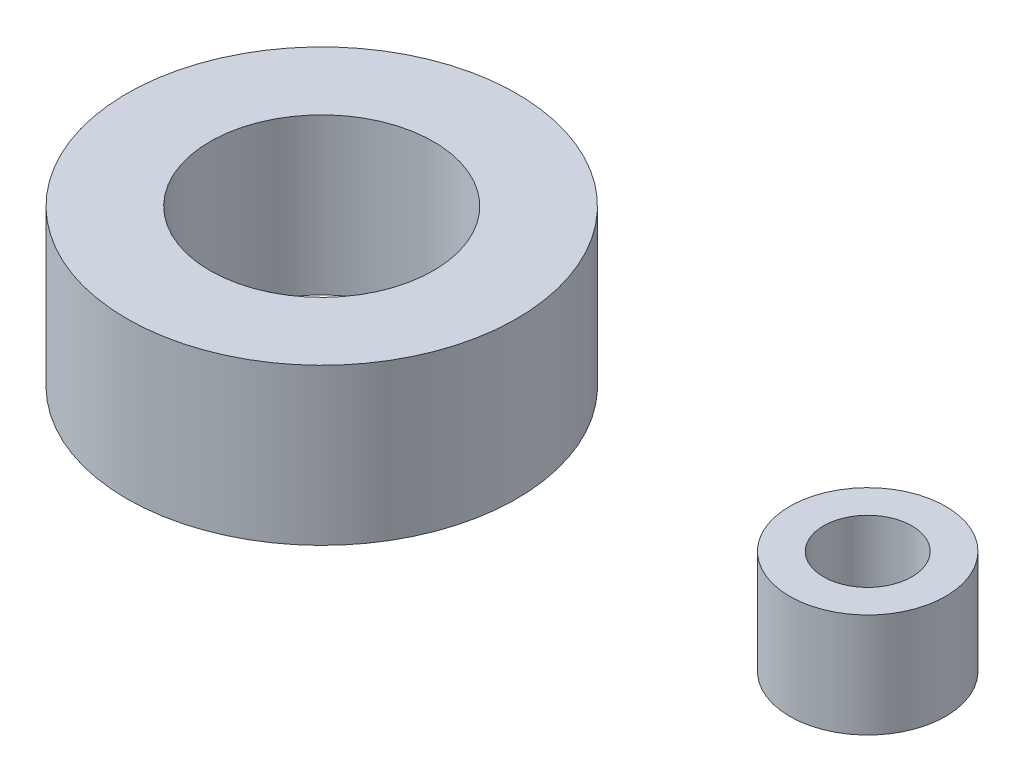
ISO-10303-21;
HEADER;
FILE_DESCRIPTION(('STEP AP214'),'2;1');
FILE_NAME('part.step','',(''),(''),'','','');
FILE_SCHEMA(('AUTOMOTIVE_DESIGN { 1 0 10303 214 1 1 1 1 }'));
ENDSEC;
DATA;
#1=APPLICATION_CONTEXT('core data for automotive mechanical design processes');
#2=APPLICATION_PROTOCOL_DEFINITION('international standard','automotive_design',2000,#1);
#3=PRODUCT_CONTEXT('',#1,'mechanical');
#4=PRODUCT('Part','Part','',(#3));
#5=PRODUCT_RELATED_PRODUCT_CATEGORY('part','',(#4));
#6=PRODUCT_DEFINITION_FORMATION('','',#4);
#7=PRODUCT_DEFINITION_CONTEXT('part definition',#1,'design');
#8=PRODUCT_DEFINITION('design','',#6,#7);
#9=PRODUCT_DEFINITION_SHAPE('','',#8);
#10=(LENGTH_UNIT() NAMED_UNIT(*) SI_UNIT(.MILLI.,.METRE.));
#11=(NAMED_UNIT(*) PLANE_ANGLE_UNIT() SI_UNIT($,.RADIAN.));
#12=(NAMED_UNIT(*) SI_UNIT($,.STERADIAN.) SOLID_ANGLE_UNIT());
#13=UNCERTAINTY_MEASURE_WITH_UNIT(LENGTH_MEASURE(1.E-05),#10,'distance_accuracy_value','');
#14=(GEOMETRIC_REPRESENTATION_CONTEXT(3) GLOBAL_UNCERTAINTY_ASSIGNED_CONTEXT((#13)) GLOBAL_UNIT_ASSIGNED_CONTEXT((#10,
#11,#12)) REPRESENTATION_CONTEXT('',''));
#15=CARTESIAN_POINT('',(0.,0.,0.));
#16=DIRECTION('',(0.,0.,1.));
#17=DIRECTION('',(1.,0.,0.));
#18=AXIS2_PLACEMENT_3D('',#15,#16,#17);
#19=CARTESIAN_POINT('',(105.,10.,0.));
#20=DIRECTION('',(0.,-1.,0.));
#21=DIRECTION('',(0.,0.,-1.));
#22=AXIS2_PLACEMENT_3D('',#19,#20,#21);
#23=CYLINDRICAL_SURFACE('',#22,8.50000000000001);
#24=CARTESIAN_POINT('',(105.,10.,0.));
#25=DIRECTION('',(0.,1.,0.));
#26=DIRECTION('',(0.,0.,1.));
#27=AXIS2_PLACEMENT_3D('',#24,#25,#26);
#28=CIRCLE('',#27,8.50000000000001);
#29=CARTESIAN_POINT('',(105.,10.,8.50000000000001));
#30=VERTEX_POINT('',#29);
#31=EDGE_CURVE('E46',#30,#30,#28,.T.);
#32=ORIENTED_EDGE('',*,*,#31,.T.);
#33=EDGE_LOOP('',(#32));
#34=FACE_BOUND('',#33,.T.);
#35=CARTESIAN_POINT('',(105.,-10.,0.));
#36=DIRECTION('',(0.,1.,0.));
#37=DIRECTION('',(0.,0.,1.));
#38=AXIS2_PLACEMENT_3D('',#35,#36,#37);
#39=CIRCLE('',#38,8.50000000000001);
#40=CARTESIAN_POINT('',(105.,-10.,8.50000000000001));
#41=VERTEX_POINT('',#40);
#42=EDGE_CURVE('E54',#41,#41,#39,.T.);
#43=ORIENTED_EDGE('',*,*,#42,.F.);
#44=EDGE_LOOP('',(#43));
#45=FACE_BOUND('',#44,.T.);
#46=ADVANCED_FACE('F40',(#34,#45),#23,.F.);
#47=CARTESIAN_POINT('',(105.,10.,0.));
#48=DIRECTION('',(0.,-1.,0.));
#49=DIRECTION('',(0.,0.,-1.));
#50=AXIS2_PLACEMENT_3D('',#47,#48,#49);
#51=CYLINDRICAL_SURFACE('',#50,15.);
#52=CARTESIAN_POINT('',(105.,10.,0.));
#53=DIRECTION('',(0.,1.,0.));
#54=DIRECTION('',(0.,0.,1.));
#55=AXIS2_PLACEMENT_3D('',#52,#53,#54);
#56=CIRCLE('',#55,15.);
#57=CARTESIAN_POINT('',(105.,10.,15.));
#58=VERTEX_POINT('',#57);
#59=EDGE_CURVE('E11',#58,#58,#56,.T.);
#60=ORIENTED_EDGE('',*,*,#59,.F.);
#61=EDGE_LOOP('',(#60));
#62=FACE_BOUND('',#61,.T.);
#63=CARTESIAN_POINT('',(105.,-10.,0.));
#64=DIRECTION('',(0.,1.,0.));
#65=DIRECTION('',(0.,0.,1.));
#66=AXIS2_PLACEMENT_3D('',#63,#64,#65);
#67=CIRCLE('',#66,15.);
#68=CARTESIAN_POINT('',(105.,-10.,15.));
#69=VERTEX_POINT('',#68);
#70=EDGE_CURVE('E50',#69,#69,#67,.T.);
#71=ORIENTED_EDGE('',*,*,#70,.T.);
#72=EDGE_LOOP('',(#71));
#73=FACE_BOUND('',#72,.T.);
#74=ADVANCED_FACE('F64',(#62,#73),#51,.T.);
#75=CARTESIAN_POINT('',(-94.7319877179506,10.,0.));
#76=DIRECTION('',(0.,1.,0.));
#77=DIRECTION('',(0.,0.,1.));
#78=AXIS2_PLACEMENT_3D('',#75,#76,#77);
#79=PLANE('',#78);
#80=ORIENTED_EDGE('',*,*,#31,.F.);
#81=EDGE_LOOP('',(#80));
#82=FACE_BOUND('',#81,.T.);
#83=ORIENTED_EDGE('',*,*,#59,.T.);
#84=EDGE_LOOP('',(#83));
#85=FACE_BOUND('',#84,.T.);
#86=ADVANCED_FACE('F68',(#82,#85),#79,.T.);
#87=CARTESIAN_POINT('',(-94.7319877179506,-10.,0.));
#88=DIRECTION('',(0.,1.,0.));
#89=DIRECTION('',(0.,0.,1.));
#90=AXIS2_PLACEMENT_3D('',#87,#88,#89);
#91=PLANE('',#90);
#92=ORIENTED_EDGE('',*,*,#42,.T.);
#93=EDGE_LOOP('',(#92));
#94=FACE_BOUND('',#93,.T.);
#95=ORIENTED_EDGE('',*,*,#70,.F.);
#96=EDGE_LOOP('',(#95));
#97=FACE_BOUND('',#96,.T.);
#98=ADVANCED_FACE('F60',(#94,#97),#91,.F.);
#99=CLOSED_SHELL('',(#46,#74,#86,#98));
#100=MANIFOLD_SOLID_BREP('B2',#99);
#101=CARTESIAN_POINT('',(0.,15.,0.));
#102=DIRECTION('',(0.,-1.,0.));
#103=DIRECTION('',(0.,0.,-1.));
#104=AXIS2_PLACEMENT_3D('',#101,#102,#103);
#105=CYLINDRICAL_SURFACE('',#104,21.5);
#106=CARTESIAN_POINT('',(0.,15.,0.));
#107=DIRECTION('',(0.,1.,0.));
#108=DIRECTION('',(0.,0.,1.));
#109=AXIS2_PLACEMENT_3D('',#106,#107,#108);
#110=CIRCLE('',#109,21.5);
#111=CARTESIAN_POINT('',(0.,15.,21.5));
#112=VERTEX_POINT('',#111);
#113=EDGE_CURVE('E107',#112,#112,#110,.T.);
#114=ORIENTED_EDGE('',*,*,#113,.T.);
#115=EDGE_LOOP('',(#114));
#116=FACE_BOUND('',#115,.T.);
#117=CARTESIAN_POINT('',(0.,-15.,0.));
#118=DIRECTION('',(0.,1.,0.));
#119=DIRECTION('',(0.,0.,1.));
#120=AXIS2_PLACEMENT_3D('',#117,#118,#119);
#121=CIRCLE('',#120,21.5);
#122=CARTESIAN_POINT('',(0.,-15.,21.5));
#123=VERTEX_POINT('',#122);
#124=EDGE_CURVE('E115',#123,#123,#121,.T.);
#125=ORIENTED_EDGE('',*,*,#124,.F.);
#126=EDGE_LOOP('',(#125));
#127=FACE_BOUND('',#126,.T.);
#128=ADVANCED_FACE('F101',(#116,#127),#105,.F.);
#129=CARTESIAN_POINT('',(0.,15.,0.));
#130=DIRECTION('',(0.,-1.,0.));
#131=DIRECTION('',(0.,0.,-1.));
#132=AXIS2_PLACEMENT_3D('',#129,#130,#131);
#133=CYLINDRICAL_SURFACE('',#132,37.5);
#134=CARTESIAN_POINT('',(0.,15.,0.));
#135=DIRECTION('',(0.,1.,0.));
#136=DIRECTION('',(0.,0.,1.));
#137=AXIS2_PLACEMENT_3D('',#134,#135,#136);
#138=CIRCLE('',#137,37.5);
#139=CARTESIAN_POINT('',(0.,15.,37.5));
#140=VERTEX_POINT('',#139);
#141=EDGE_CURVE('E39',#140,#140,#138,.T.);
#142=ORIENTED_EDGE('',*,*,#141,.F.);
#143=EDGE_LOOP('',(#142));
#144=FACE_BOUND('',#143,.T.);
#145=CARTESIAN_POINT('',(0.,-15.,0.));
#146=DIRECTION('',(0.,1.,0.));
#147=DIRECTION('',(0.,0.,1.));
#148=AXIS2_PLACEMENT_3D('',#145,#146,#147);
#149=CIRCLE('',#148,37.5);
#150=CARTESIAN_POINT('',(0.,-15.,37.5));
#151=VERTEX_POINT('',#150);
#152=EDGE_CURVE('E111',#151,#151,#149,.T.);
#153=ORIENTED_EDGE('',*,*,#152,.T.);
#154=EDGE_LOOP('',(#153));
#155=FACE_BOUND('',#154,.T.);
#156=ADVANCED_FACE('F125',(#144,#155),#133,.T.);
#157=CARTESIAN_POINT('',(-94.5782160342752,15.,0.));
#158=DIRECTION('',(0.,1.,0.));
#159=DIRECTION('',(0.,0.,1.));
#160=AXIS2_PLACEMENT_3D('',#157,#158,#159);
#161=PLANE('',#160);
#162=ORIENTED_EDGE('',*,*,#113,.F.);
#163=EDGE_LOOP('',(#162));
#164=FACE_BOUND('',#163,.T.);
#165=ORIENTED_EDGE('',*,*,#141,.T.);
#166=EDGE_LOOP('',(#165));
#167=FACE_BOUND('',#166,.T.);
#168=ADVANCED_FACE('F129',(#164,#167),#161,.T.);
#169=CARTESIAN_POINT('',(-94.5782160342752,-15.,0.));
#170=DIRECTION('',(0.,1.,0.));
#171=DIRECTION('',(0.,0.,1.));
#172=AXIS2_PLACEMENT_3D('',#169,#170,#171);
#173=PLANE('',#172);
#174=ORIENTED_EDGE('',*,*,#124,.T.);
#175=EDGE_LOOP('',(#174));
#176=FACE_BOUND('',#175,.T.);
#177=ORIENTED_EDGE('',*,*,#152,.F.);
#178=EDGE_LOOP('',(#177));
#179=FACE_BOUND('',#178,.T.);
#180=ADVANCED_FACE('F121',(#176,#179),#173,.F.);
#181=CLOSED_SHELL('',(#128,#156,#168,#180));
#182=MANIFOLD_SOLID_BREP('B6',#181);
#183=ADVANCED_BREP_SHAPE_REPRESENTATION('',(#18,#100,#182),#14);
#184=SHAPE_DEFINITION_REPRESENTATION(#9,#183);
ENDSEC;
END-ISO-10303-21;
